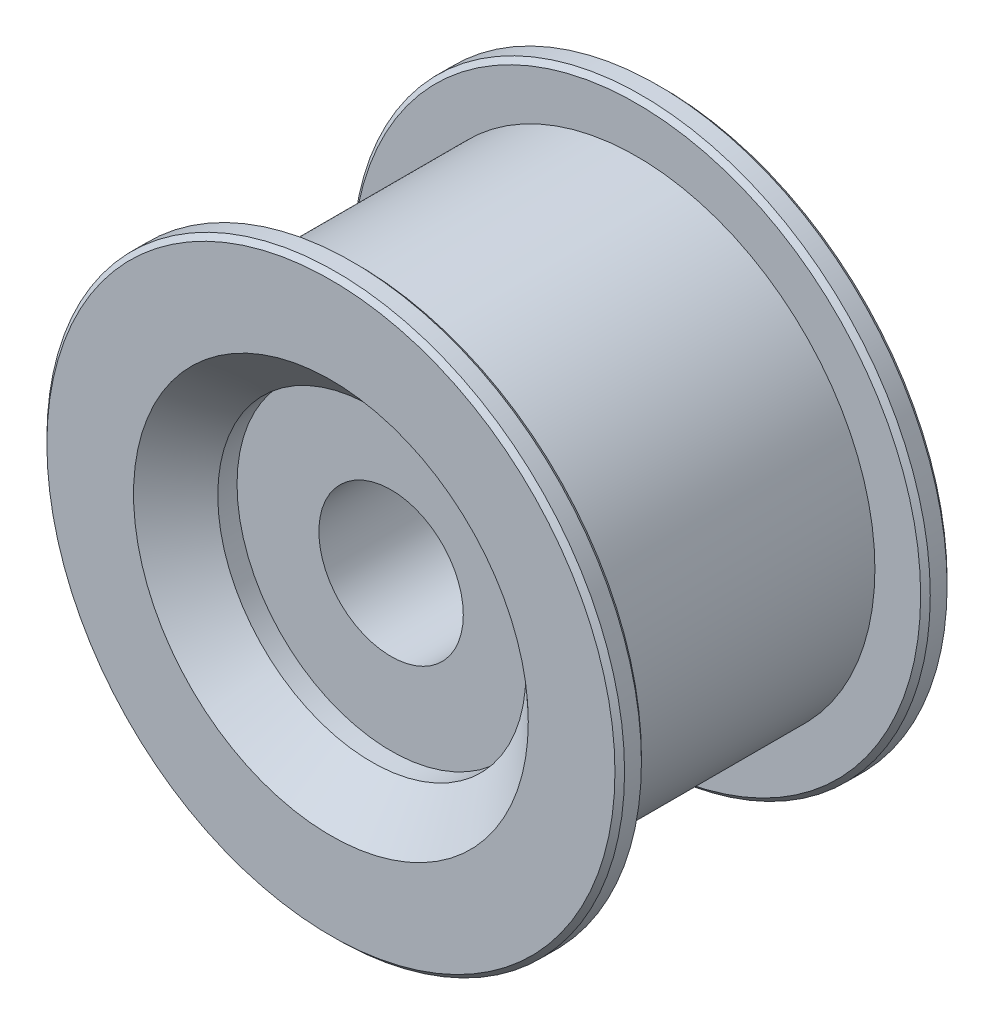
ISO-10303-21;
HEADER;
FILE_DESCRIPTION(('STEP AP214'),'2;1');
FILE_NAME('part.step','',(''),(''),'','','');
FILE_SCHEMA(('AUTOMOTIVE_DESIGN { 1 0 10303 214 1 1 1 1 }'));
ENDSEC;
DATA;
#1=APPLICATION_CONTEXT('core data for automotive mechanical design processes');
#2=APPLICATION_PROTOCOL_DEFINITION('international standard','automotive_design',2000,#1);
#3=PRODUCT_CONTEXT('',#1,'mechanical');
#4=PRODUCT('Part','Part','',(#3));
#5=PRODUCT_RELATED_PRODUCT_CATEGORY('part','',(#4));
#6=PRODUCT_DEFINITION_FORMATION('','',#4);
#7=PRODUCT_DEFINITION_CONTEXT('part definition',#1,'design');
#8=PRODUCT_DEFINITION('design','',#6,#7);
#9=PRODUCT_DEFINITION_SHAPE('','',#8);
#10=(LENGTH_UNIT() NAMED_UNIT(*) SI_UNIT(.MILLI.,.METRE.));
#11=(NAMED_UNIT(*) PLANE_ANGLE_UNIT() SI_UNIT($,.RADIAN.));
#12=(NAMED_UNIT(*) SI_UNIT($,.STERADIAN.) SOLID_ANGLE_UNIT());
#13=UNCERTAINTY_MEASURE_WITH_UNIT(LENGTH_MEASURE(1.E-05),#10,'distance_accuracy_value','');
#14=(GEOMETRIC_REPRESENTATION_CONTEXT(3) GLOBAL_UNCERTAINTY_ASSIGNED_CONTEXT((#13)) GLOBAL_UNIT_ASSIGNED_CONTEXT((#10,
#11,#12)) REPRESENTATION_CONTEXT('',''));
#15=CARTESIAN_POINT('',(0.,0.,0.));
#16=DIRECTION('',(0.,0.,1.));
#17=DIRECTION('',(1.,0.,0.));
#18=AXIS2_PLACEMENT_3D('',#15,#16,#17);
#19=CARTESIAN_POINT('',(0.,-7.5,-11.));
#20=DIRECTION('',(0.,0.,-1.));
#21=DIRECTION('',(1.,0.,0.));
#22=AXIS2_PLACEMENT_3D('',#19,#20,#21);
#23=PLANE('',#22);
#24=CARTESIAN_POINT('',(0.,0.,-11.));
#25=DIRECTION('',(0.,0.,-1.));
#26=DIRECTION('',(1.,0.,0.));
#27=AXIS2_PLACEMENT_3D('',#24,#25,#26);
#28=CIRCLE('',#27,16.);
#29=CARTESIAN_POINT('',(16.,0.,-11.));
#30=VERTEX_POINT('',#29);
#31=EDGE_CURVE('E71',#30,#30,#28,.T.);
#32=ORIENTED_EDGE('',*,*,#31,.T.);
#33=EDGE_LOOP('',(#32));
#34=FACE_BOUND('',#33,.T.);
#35=CARTESIAN_POINT('',(0.,0.,-11.));
#36=DIRECTION('',(0.,0.,-1.));
#37=DIRECTION('',(1.,0.,0.));
#38=AXIS2_PLACEMENT_3D('',#35,#36,#37);
#39=CIRCLE('',#38,7.5);
#40=CARTESIAN_POINT('',(7.5,0.,-11.));
#41=VERTEX_POINT('',#40);
#42=EDGE_CURVE('E44',#41,#41,#39,.T.);
#43=ORIENTED_EDGE('',*,*,#42,.F.);
#44=EDGE_LOOP('',(#43));
#45=FACE_BOUND('',#44,.T.);
#46=ADVANCED_FACE('F12',(#34,#45),#23,.T.);
#47=CARTESIAN_POINT('',(0.,0.,-20.));
#48=DIRECTION('',(0.,0.,-1.));
#49=DIRECTION('',(1.,0.,0.));
#50=AXIS2_PLACEMENT_3D('',#47,#48,#49);
#51=CYLINDRICAL_SURFACE('',#50,7.5);
#52=ORIENTED_EDGE('',*,*,#42,.T.);
#53=EDGE_LOOP('',(#52));
#54=FACE_BOUND('',#53,.T.);
#55=CARTESIAN_POINT('',(0.,0.,11.));
#56=DIRECTION('',(0.,0.,-1.));
#57=DIRECTION('',(1.,0.,0.));
#58=AXIS2_PLACEMENT_3D('',#55,#56,#57);
#59=CIRCLE('',#58,7.5);
#60=CARTESIAN_POINT('',(7.5,0.,11.));
#61=VERTEX_POINT('',#60);
#62=EDGE_CURVE('E47',#61,#61,#59,.T.);
#63=ORIENTED_EDGE('',*,*,#62,.F.);
#64=EDGE_LOOP('',(#63));
#65=FACE_BOUND('',#64,.T.);
#66=ADVANCED_FACE('F96',(#54,#65),#51,.F.);
#67=CARTESIAN_POINT('',(0.,-7.5,11.));
#68=DIRECTION('',(0.,0.,-1.));
#69=DIRECTION('',(1.,0.,0.));
#70=AXIS2_PLACEMENT_3D('',#67,#68,#69);
#71=PLANE('',#70);
#72=CARTESIAN_POINT('',(0.,0.,11.));
#73=DIRECTION('',(0.,0.,-1.));
#74=DIRECTION('',(1.,0.,0.));
#75=AXIS2_PLACEMENT_3D('',#72,#73,#74);
#76=CIRCLE('',#75,16.);
#77=CARTESIAN_POINT('',(16.,0.,11.));
#78=VERTEX_POINT('',#77);
#79=EDGE_CURVE('E50',#78,#78,#76,.T.);
#80=ORIENTED_EDGE('',*,*,#79,.F.);
#81=EDGE_LOOP('',(#80));
#82=FACE_BOUND('',#81,.T.);
#83=ORIENTED_EDGE('',*,*,#62,.T.);
#84=EDGE_LOOP('',(#83));
#85=FACE_BOUND('',#84,.T.);
#86=ADVANCED_FACE('F102',(#82,#85),#71,.F.);
#87=CARTESIAN_POINT('',(0.,0.,-20.));
#88=DIRECTION('',(0.,0.,-1.));
#89=DIRECTION('',(1.,0.,0.));
#90=AXIS2_PLACEMENT_3D('',#87,#88,#89);
#91=CYLINDRICAL_SURFACE('',#90,16.);
#92=CARTESIAN_POINT('',(0.,0.,13.));
#93=DIRECTION('',(0.,0.,-1.));
#94=DIRECTION('',(1.,0.,0.));
#95=AXIS2_PLACEMENT_3D('',#92,#93,#94);
#96=CIRCLE('',#95,16.);
#97=CARTESIAN_POINT('',(16.,0.,13.));
#98=VERTEX_POINT('',#97);
#99=EDGE_CURVE('E53',#98,#98,#96,.T.);
#100=ORIENTED_EDGE('',*,*,#99,.F.);
#101=EDGE_LOOP('',(#100));
#102=FACE_BOUND('',#101,.T.);
#103=ORIENTED_EDGE('',*,*,#79,.T.);
#104=EDGE_LOOP('',(#103));
#105=FACE_BOUND('',#104,.T.);
#106=ADVANCED_FACE('F141',(#102,#105),#91,.F.);
#107=CARTESIAN_POINT('',(0.,0.,13.));
#108=DIRECTION('',(0.,0.,1.));
#109=DIRECTION('',(-1.,0.,0.));
#110=AXIS2_PLACEMENT_3D('',#107,#108,#109);
#111=CONICAL_SURFACE('',#110,16.,0.813961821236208);
#112=CARTESIAN_POINT('',(0.,0.,17.25));
#113=DIRECTION('',(0.,0.,-1.));
#114=DIRECTION('',(1.,0.,0.));
#115=AXIS2_PLACEMENT_3D('',#112,#113,#114);
#116=CIRCLE('',#115,20.5);
#117=CARTESIAN_POINT('',(20.5,0.,17.25));
#118=VERTEX_POINT('',#117);
#119=EDGE_CURVE('E56',#118,#118,#116,.T.);
#120=ORIENTED_EDGE('',*,*,#119,.F.);
#121=EDGE_LOOP('',(#120));
#122=FACE_BOUND('',#121,.T.);
#123=ORIENTED_EDGE('',*,*,#99,.T.);
#124=EDGE_LOOP('',(#123));
#125=FACE_BOUND('',#124,.T.);
#126=ADVANCED_FACE('F135',(#122,#125),#111,.F.);
#127=CARTESIAN_POINT('',(0.,-30.,17.25));
#128=DIRECTION('',(0.,0.,1.));
#129=DIRECTION('',(-1.,0.,0.));
#130=AXIS2_PLACEMENT_3D('',#127,#128,#129);
#131=PLANE('',#130);
#132=CARTESIAN_POINT('',(0.,0.,17.25));
#133=DIRECTION('',(0.,0.,1.));
#134=DIRECTION('',(1.,0.,0.));
#135=AXIS2_PLACEMENT_3D('',#132,#133,#134);
#136=CIRCLE('',#135,29.5);
#137=CARTESIAN_POINT('',(29.5,0.,17.25));
#138=VERTEX_POINT('',#137);
#139=EDGE_CURVE('E19',#138,#138,#136,.T.);
#140=ORIENTED_EDGE('',*,*,#139,.T.);
#141=EDGE_LOOP('',(#140));
#142=FACE_BOUND('',#141,.T.);
#143=ORIENTED_EDGE('',*,*,#119,.T.);
#144=EDGE_LOOP('',(#143));
#145=FACE_BOUND('',#144,.T.);
#146=ADVANCED_FACE('F124',(#142,#145),#131,.T.);
#147=CARTESIAN_POINT('',(0.,0.,-20.));
#148=DIRECTION('',(0.,0.,-1.));
#149=DIRECTION('',(1.,0.,0.));
#150=AXIS2_PLACEMENT_3D('',#147,#148,#149);
#151=CYLINDRICAL_SURFACE('',#150,30.);
#152=CARTESIAN_POINT('',(0.,0.,16.75));
#153=DIRECTION('',(0.,0.,1.));
#154=DIRECTION('',(1.,0.,0.));
#155=AXIS2_PLACEMENT_3D('',#152,#153,#154);
#156=CIRCLE('',#155,30.);
#157=CARTESIAN_POINT('',(30.,0.,16.75));
#158=VERTEX_POINT('',#157);
#159=EDGE_CURVE('E23',#158,#158,#156,.F.);
#160=ORIENTED_EDGE('',*,*,#159,.T.);
#161=EDGE_LOOP('',(#160));
#162=FACE_BOUND('',#161,.T.);
#163=CARTESIAN_POINT('',(0.,0.,15.));
#164=DIRECTION('',(0.,0.,1.));
#165=DIRECTION('',(1.,0.,0.));
#166=AXIS2_PLACEMENT_3D('',#163,#164,#165);
#167=CIRCLE('',#166,30.);
#168=CARTESIAN_POINT('',(30.,0.,15.));
#169=VERTEX_POINT('',#168);
#170=EDGE_CURVE('E27',#169,#169,#167,.T.);
#171=ORIENTED_EDGE('',*,*,#170,.T.);
#172=EDGE_LOOP('',(#171));
#173=FACE_BOUND('',#172,.T.);
#174=ADVANCED_FACE('F120',(#162,#173),#151,.T.);
#175=CARTESIAN_POINT('',(0.,-30.,14.5));
#176=DIRECTION('',(0.,0.,1.));
#177=DIRECTION('',(-1.,0.,0.));
#178=AXIS2_PLACEMENT_3D('',#175,#176,#177);
#179=PLANE('',#178);
#180=CARTESIAN_POINT('',(0.,0.,14.5));
#181=DIRECTION('',(0.,0.,1.));
#182=DIRECTION('',(1.,0.,0.));
#183=AXIS2_PLACEMENT_3D('',#180,#181,#182);
#184=CIRCLE('',#183,29.5);
#185=CARTESIAN_POINT('',(29.5,0.,14.5));
#186=VERTEX_POINT('',#185);
#187=EDGE_CURVE('E8',#186,#186,#184,.F.);
#188=ORIENTED_EDGE('',*,*,#187,.T.);
#189=EDGE_LOOP('',(#188));
#190=FACE_BOUND('',#189,.T.);
#191=CARTESIAN_POINT('',(0.,0.,14.5));
#192=DIRECTION('',(0.,0.,-1.));
#193=DIRECTION('',(1.,0.,0.));
#194=AXIS2_PLACEMENT_3D('',#191,#192,#193);
#195=CIRCLE('',#194,24.75);
#196=CARTESIAN_POINT('',(24.75,0.,14.5));
#197=VERTEX_POINT('',#196);
#198=EDGE_CURVE('E59',#197,#197,#195,.T.);
#199=ORIENTED_EDGE('',*,*,#198,.F.);
#200=EDGE_LOOP('',(#199));
#201=FACE_BOUND('',#200,.T.);
#202=ADVANCED_FACE('F123',(#190,#201),#179,.F.);
#203=CARTESIAN_POINT('',(0.,0.,-20.));
#204=DIRECTION('',(0.,0.,-1.));
#205=DIRECTION('',(1.,0.,0.));
#206=AXIS2_PLACEMENT_3D('',#203,#204,#205);
#207=CYLINDRICAL_SURFACE('',#206,24.75);
#208=ORIENTED_EDGE('',*,*,#198,.T.);
#209=EDGE_LOOP('',(#208));
#210=FACE_BOUND('',#209,.T.);
#211=CARTESIAN_POINT('',(0.,0.,-14.5));
#212=DIRECTION('',(0.,0.,-1.));
#213=DIRECTION('',(1.,0.,0.));
#214=AXIS2_PLACEMENT_3D('',#211,#212,#213);
#215=CIRCLE('',#214,24.75);
#216=CARTESIAN_POINT('',(24.75,0.,-14.5));
#217=VERTEX_POINT('',#216);
#218=EDGE_CURVE('E62',#217,#217,#215,.T.);
#219=ORIENTED_EDGE('',*,*,#218,.F.);
#220=EDGE_LOOP('',(#219));
#221=FACE_BOUND('',#220,.T.);
#222=ADVANCED_FACE('F133',(#210,#221),#207,.T.);
#223=CARTESIAN_POINT('',(0.,-30.,-14.5));
#224=DIRECTION('',(0.,0.,1.));
#225=DIRECTION('',(-1.,0.,0.));
#226=AXIS2_PLACEMENT_3D('',#223,#224,#225);
#227=PLANE('',#226);
#228=CARTESIAN_POINT('',(0.,0.,-14.5));
#229=DIRECTION('',(0.,0.,1.));
#230=DIRECTION('',(1.,0.,0.));
#231=AXIS2_PLACEMENT_3D('',#228,#229,#230);
#232=CIRCLE('',#231,29.5);
#233=CARTESIAN_POINT('',(29.5,0.,-14.5));
#234=VERTEX_POINT('',#233);
#235=EDGE_CURVE('E32',#234,#234,#232,.T.);
#236=ORIENTED_EDGE('',*,*,#235,.T.);
#237=EDGE_LOOP('',(#236));
#238=FACE_BOUND('',#237,.T.);
#239=ORIENTED_EDGE('',*,*,#218,.T.);
#240=EDGE_LOOP('',(#239));
#241=FACE_BOUND('',#240,.T.);
#242=ADVANCED_FACE('F245',(#238,#241),#227,.T.);
#243=CARTESIAN_POINT('',(0.,0.,-20.));
#244=DIRECTION('',(0.,0.,-1.));
#245=DIRECTION('',(1.,0.,0.));
#246=AXIS2_PLACEMENT_3D('',#243,#244,#245);
#247=CYLINDRICAL_SURFACE('',#246,30.);
#248=CARTESIAN_POINT('',(0.,0.,-16.75));
#249=DIRECTION('',(0.,0.,1.));
#250=DIRECTION('',(1.,0.,0.));
#251=AXIS2_PLACEMENT_3D('',#248,#249,#250);
#252=CIRCLE('',#251,30.);
#253=CARTESIAN_POINT('',(30.,0.,-16.75));
#254=VERTEX_POINT('',#253);
#255=EDGE_CURVE('E35',#254,#254,#252,.T.);
#256=ORIENTED_EDGE('',*,*,#255,.T.);
#257=EDGE_LOOP('',(#256));
#258=FACE_BOUND('',#257,.T.);
#259=CARTESIAN_POINT('',(0.,0.,-15.));
#260=DIRECTION('',(0.,0.,1.));
#261=DIRECTION('',(1.,0.,0.));
#262=AXIS2_PLACEMENT_3D('',#259,#260,#261);
#263=CIRCLE('',#262,30.);
#264=CARTESIAN_POINT('',(30.,0.,-15.));
#265=VERTEX_POINT('',#264);
#266=EDGE_CURVE('E38',#265,#265,#263,.F.);
#267=ORIENTED_EDGE('',*,*,#266,.T.);
#268=EDGE_LOOP('',(#267));
#269=FACE_BOUND('',#268,.T.);
#270=ADVANCED_FACE('F237',(#258,#269),#247,.T.);
#271=CARTESIAN_POINT('',(0.,-30.,-17.25));
#272=DIRECTION('',(0.,0.,1.));
#273=DIRECTION('',(-1.,0.,0.));
#274=AXIS2_PLACEMENT_3D('',#271,#272,#273);
#275=PLANE('',#274);
#276=CARTESIAN_POINT('',(0.,0.,-17.25));
#277=DIRECTION('',(0.,0.,1.));
#278=DIRECTION('',(1.,0.,0.));
#279=AXIS2_PLACEMENT_3D('',#276,#277,#278);
#280=CIRCLE('',#279,29.5);
#281=CARTESIAN_POINT('',(29.5,0.,-17.25));
#282=VERTEX_POINT('',#281);
#283=EDGE_CURVE('E41',#282,#282,#280,.F.);
#284=ORIENTED_EDGE('',*,*,#283,.T.);
#285=EDGE_LOOP('',(#284));
#286=FACE_BOUND('',#285,.T.);
#287=CARTESIAN_POINT('',(0.,0.,-17.25));
#288=DIRECTION('',(0.,0.,-1.));
#289=DIRECTION('',(1.,0.,0.));
#290=AXIS2_PLACEMENT_3D('',#287,#288,#289);
#291=CIRCLE('',#290,20.5);
#292=CARTESIAN_POINT('',(20.5,0.,-17.25));
#293=VERTEX_POINT('',#292);
#294=EDGE_CURVE('E65',#293,#293,#291,.T.);
#295=ORIENTED_EDGE('',*,*,#294,.F.);
#296=EDGE_LOOP('',(#295));
#297=FACE_BOUND('',#296,.T.);
#298=ADVANCED_FACE('F92',(#286,#297),#275,.F.);
#299=CARTESIAN_POINT('',(0.,0.,-13.));
#300=DIRECTION('',(0.,0.,-1.));
#301=DIRECTION('',(1.,0.,0.));
#302=AXIS2_PLACEMENT_3D('',#299,#300,#301);
#303=CONICAL_SURFACE('',#302,16.,0.813961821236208);
#304=ORIENTED_EDGE('',*,*,#294,.T.);
#305=EDGE_LOOP('',(#304));
#306=FACE_BOUND('',#305,.T.);
#307=CARTESIAN_POINT('',(0.,0.,-13.));
#308=DIRECTION('',(0.,0.,-1.));
#309=DIRECTION('',(1.,0.,0.));
#310=AXIS2_PLACEMENT_3D('',#307,#308,#309);
#311=CIRCLE('',#310,16.);
#312=CARTESIAN_POINT('',(16.,0.,-13.));
#313=VERTEX_POINT('',#312);
#314=EDGE_CURVE('E68',#313,#313,#311,.T.);
#315=ORIENTED_EDGE('',*,*,#314,.F.);
#316=EDGE_LOOP('',(#315));
#317=FACE_BOUND('',#316,.T.);
#318=ADVANCED_FACE('F80',(#306,#317),#303,.F.);
#319=CARTESIAN_POINT('',(0.,0.,-20.));
#320=DIRECTION('',(0.,0.,-1.));
#321=DIRECTION('',(1.,0.,0.));
#322=AXIS2_PLACEMENT_3D('',#319,#320,#321);
#323=CYLINDRICAL_SURFACE('',#322,16.);
#324=ORIENTED_EDGE('',*,*,#314,.T.);
#325=EDGE_LOOP('',(#324));
#326=FACE_BOUND('',#325,.T.);
#327=ORIENTED_EDGE('',*,*,#31,.F.);
#328=EDGE_LOOP('',(#327));
#329=FACE_BOUND('',#328,.T.);
#330=ADVANCED_FACE('F77',(#326,#329),#323,.F.);
#331=CARTESIAN_POINT('',(0.,0.,-17.25));
#332=DIRECTION('',(0.,0.,1.));
#333=DIRECTION('',(1.,0.,0.));
#334=AXIS2_PLACEMENT_3D('',#331,#332,#333);
#335=CONICAL_SURFACE('',#334,29.5,0.785398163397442);
#336=ORIENTED_EDGE('',*,*,#255,.F.);
#337=EDGE_LOOP('',(#336));
#338=FACE_BOUND('',#337,.T.);
#339=ORIENTED_EDGE('',*,*,#283,.F.);
#340=EDGE_LOOP('',(#339));
#341=FACE_BOUND('',#340,.T.);
#342=ADVANCED_FACE('F79',(#338,#341),#335,.T.);
#343=CARTESIAN_POINT('',(0.,0.,-15.));
#344=DIRECTION('',(0.,0.,-1.));
#345=DIRECTION('',(-1.,0.,0.));
#346=AXIS2_PLACEMENT_3D('',#343,#344,#345);
#347=CONICAL_SURFACE('',#346,30.,0.785398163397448);
#348=ORIENTED_EDGE('',*,*,#235,.F.);
#349=EDGE_LOOP('',(#348));
#350=FACE_BOUND('',#349,.T.);
#351=ORIENTED_EDGE('',*,*,#266,.F.);
#352=EDGE_LOOP('',(#351));
#353=FACE_BOUND('',#352,.T.);
#354=ADVANCED_FACE('F89',(#350,#353),#347,.T.);
#355=CARTESIAN_POINT('',(0.,0.,16.75));
#356=DIRECTION('',(0.,0.,-1.));
#357=DIRECTION('',(-1.,0.,0.));
#358=AXIS2_PLACEMENT_3D('',#355,#356,#357);
#359=CONICAL_SURFACE('',#358,30.,0.785398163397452);
#360=ORIENTED_EDGE('',*,*,#139,.F.);
#361=EDGE_LOOP('',(#360));
#362=FACE_BOUND('',#361,.T.);
#363=ORIENTED_EDGE('',*,*,#159,.F.);
#364=EDGE_LOOP('',(#363));
#365=FACE_BOUND('',#364,.T.);
#366=ADVANCED_FACE('F108',(#362,#365),#359,.T.);
#367=CARTESIAN_POINT('',(0.,0.,14.5));
#368=DIRECTION('',(0.,0.,1.));
#369=DIRECTION('',(1.,0.,0.));
#370=AXIS2_PLACEMENT_3D('',#367,#368,#369);
#371=CONICAL_SURFACE('',#370,29.5,0.785398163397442);
#372=ORIENTED_EDGE('',*,*,#170,.F.);
#373=EDGE_LOOP('',(#372));
#374=FACE_BOUND('',#373,.T.);
#375=ORIENTED_EDGE('',*,*,#187,.F.);
#376=EDGE_LOOP('',(#375));
#377=FACE_BOUND('',#376,.T.);
#378=ADVANCED_FACE('F14',(#374,#377),#371,.T.);
#379=CLOSED_SHELL('',(#46,#66,#86,#106,#126,#146,#174,#202,#222,#242,#270,#298,#318,#330,#342,
#354,#366,#378));
#380=MANIFOLD_SOLID_BREP('B1',#379);
#381=ADVANCED_BREP_SHAPE_REPRESENTATION('',(#18,#380),#14);
#382=SHAPE_DEFINITION_REPRESENTATION(#9,#381);
ENDSEC;
END-ISO-10303-21;
